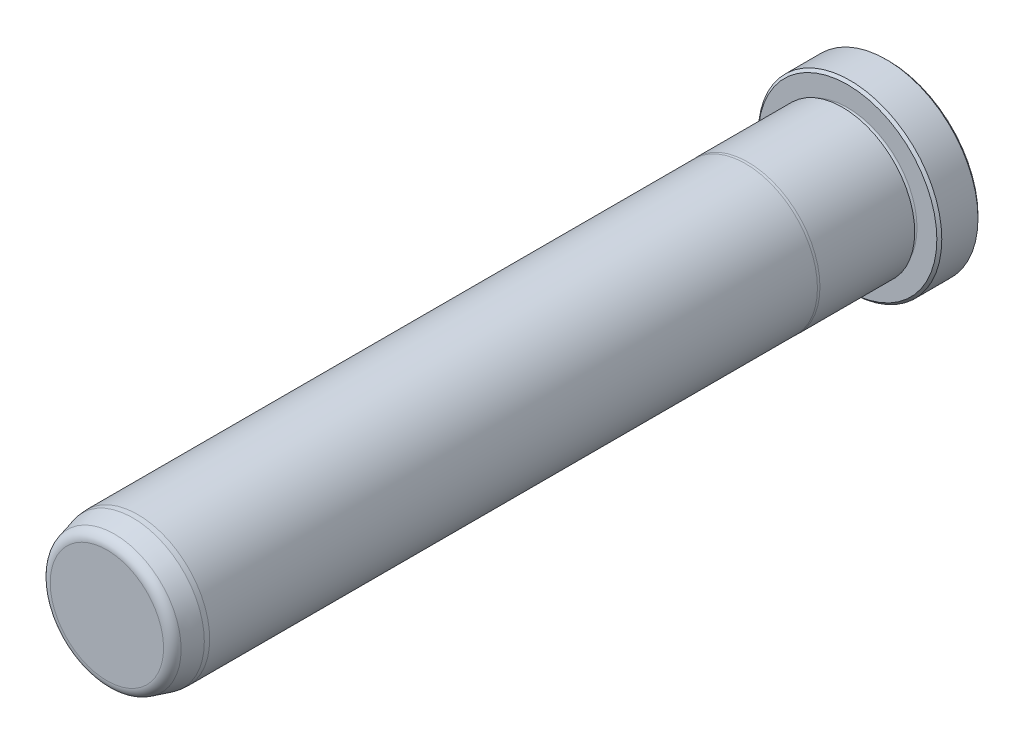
from build123d import *

# Parameters (mm, degrees)
FILLET6_R     = 1.5875
CHAMFER1_SIZE = 0.381


with BuildPart() as part:
    # Sketch1 → Revolve1 (revolve)
    with BuildSketch(Plane(origin=(0, 0, 0), x_dir=(0, 0, -1), z_dir=(1, 0, 0)), mode=Mode.PRIVATE) as revolve1_sk:
        with BuildLine():
            Line((0, 0), (0, 14.1605))
            Line((0, 14.1605), (-6.35, 14.1605))
            Line((-6.35, 14.1605), (-6.35, 10.7188))
            ThreePointArc((-6.35, 10.7188), (-6.731, 10.3378), (-7.112, 10.7188))
            Line((-7.112, 10.7188), (-7.112, 11.1252))
            Line((-7.112, 11.1252), (-21.734763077, 11.1252))
            Line((-21.734763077, 11.1252), (-22.098, 11.0998))
            Line((-22.098, 11.0998), (-115.8875, 11.0998))
            Line((-115.8875, 11.0998), (-116.6495, 11.033133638))
            Line((-116.6495, 11.033133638), (-120.65, 9.961202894))
            Line((-120.65, 9.961202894), (-120.65, 0))
            Line((-120.65, 0), (0, 0))
        make_face()
    revolve(revolve1_sk.sketch.rotate(Axis((0, 0, 0), (0, 0, -1)), 90), axis=Axis((0, 0, 0), (0, 0, -1)))

    # Fillet6
    fillet6_edges = [part.edges().sort_by_distance(p)[0] for p in [
        (-9.961202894, 0, 120.65),
    ]]
    fillet(fillet6_edges, radius=FILLET6_R)

    # Chamfer1
    chamfer1_edges = [part.edges().sort_by_distance(p)[0] for p in [
        (-14.1605, 0, 6.35),
        (-14.1605, 0, 0),
    ]]
    chamfer(chamfer1_edges, length=CHAMFER1_SIZE)


solid = part.part
